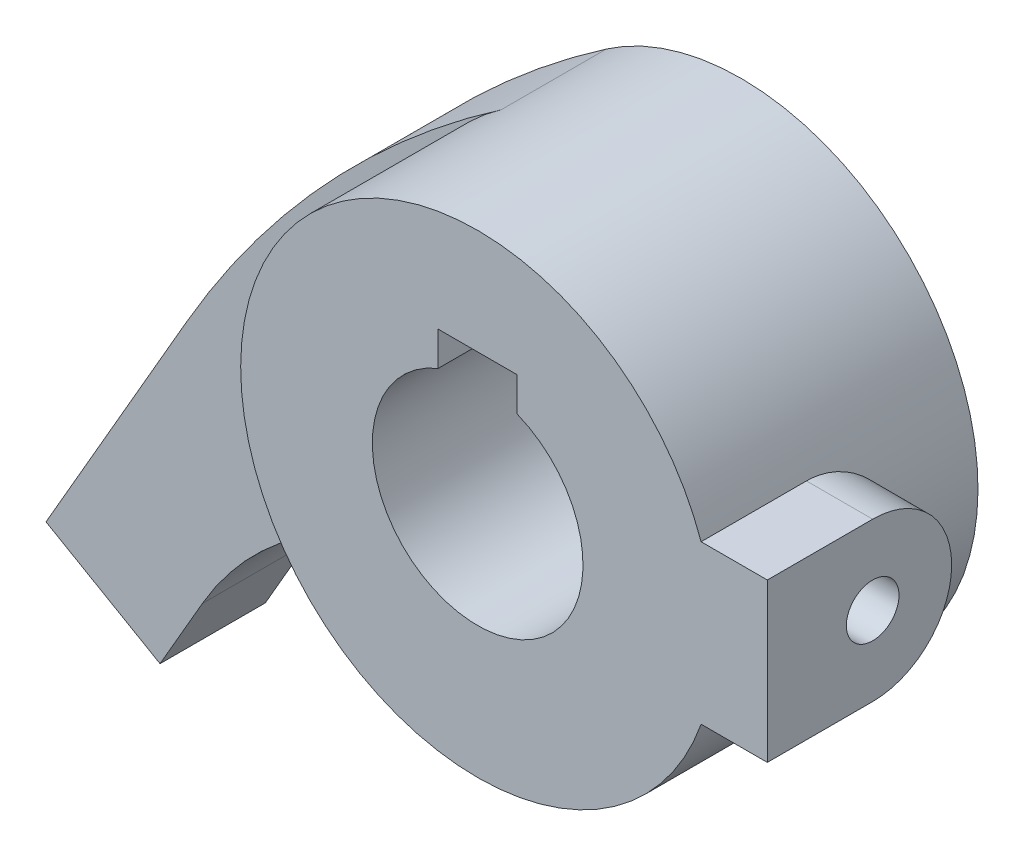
ISO-10303-21;
HEADER;
FILE_DESCRIPTION(('STEP AP214'),'2;1');
FILE_NAME('part.step','',(''),(''),'','','');
FILE_SCHEMA(('AUTOMOTIVE_DESIGN { 1 0 10303 214 1 1 1 1 }'));
ENDSEC;
DATA;
#1=APPLICATION_CONTEXT('core data for automotive mechanical design processes');
#2=APPLICATION_PROTOCOL_DEFINITION('international standard','automotive_design',2000,#1);
#3=PRODUCT_CONTEXT('',#1,'mechanical');
#4=PRODUCT('Part','Part','',(#3));
#5=PRODUCT_RELATED_PRODUCT_CATEGORY('part','',(#4));
#6=PRODUCT_DEFINITION_FORMATION('','',#4);
#7=PRODUCT_DEFINITION_CONTEXT('part definition',#1,'design');
#8=PRODUCT_DEFINITION('design','',#6,#7);
#9=PRODUCT_DEFINITION_SHAPE('','',#8);
#10=(LENGTH_UNIT() NAMED_UNIT(*) SI_UNIT(.MILLI.,.METRE.));
#11=(NAMED_UNIT(*) PLANE_ANGLE_UNIT() SI_UNIT($,.RADIAN.));
#12=(NAMED_UNIT(*) SI_UNIT($,.STERADIAN.) SOLID_ANGLE_UNIT());
#13=UNCERTAINTY_MEASURE_WITH_UNIT(LENGTH_MEASURE(1.E-05),#10,'distance_accuracy_value','');
#14=(GEOMETRIC_REPRESENTATION_CONTEXT(3) GLOBAL_UNCERTAINTY_ASSIGNED_CONTEXT((#13)) GLOBAL_UNIT_ASSIGNED_CONTEXT((#10,
#11,#12)) REPRESENTATION_CONTEXT('',''));
#15=CARTESIAN_POINT('',(0.,0.,0.));
#16=DIRECTION('',(0.,0.,1.));
#17=DIRECTION('',(1.,0.,0.));
#18=AXIS2_PLACEMENT_3D('',#15,#16,#17);
#19=CARTESIAN_POINT('',(0.,0.,20.));
#20=DIRECTION('',(0.,0.,-1.));
#21=DIRECTION('',(-1.,0.,0.));
#22=AXIS2_PLACEMENT_3D('',#19,#20,#21);
#23=CYLINDRICAL_SURFACE('',#22,18.);
#24=CARTESIAN_POINT('',(0.,0.,20.));
#25=DIRECTION('',(0.,0.,1.));
#26=DIRECTION('',(1.,0.,0.));
#27=AXIS2_PLACEMENT_3D('',#24,#25,#26);
#28=CIRCLE('',#27,18.);
#29=CARTESIAN_POINT('',(16.9705627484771,6.,20.));
#30=VERTEX_POINT('',#29);
#31=CARTESIAN_POINT('',(16.9705627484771,-6.,20.));
#32=VERTEX_POINT('',#31);
#33=EDGE_CURVE('E56',#30,#32,#28,.T.);
#34=ORIENTED_EDGE('',*,*,#33,.F.);
#35=DIRECTION('',(0.,0.,-1.));
#36=VECTOR('',#35,1.);
#37=CARTESIAN_POINT('',(16.9705627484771,6.,20.));
#38=LINE('',#37,#36);
#39=CARTESIAN_POINT('',(16.9705627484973,6.,12.));
#40=VERTEX_POINT('',#39);
#41=EDGE_CURVE('E171',#40,#30,#38,.F.);
#42=ORIENTED_EDGE('',*,*,#41,.F.);
#43=CARTESIAN_POINT('',(16.9705627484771,-6.,12.));
#44=CARTESIAN_POINT('',(16.9705358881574,-6.00002327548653,11.8363059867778));
#45=CARTESIAN_POINT('',(16.9729302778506,-5.99330214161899,11.6726221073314));
#46=CARTESIAN_POINT('',(16.9823649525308,-5.96654425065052,11.3465240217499));
#47=CARTESIAN_POINT('',(16.9894039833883,-5.94651108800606,11.1841094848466));
#48=CARTESIAN_POINT('',(17.0079041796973,-5.89338071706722,10.8621857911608));
#49=CARTESIAN_POINT('',(17.0193522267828,-5.86032225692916,10.7026694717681));
#50=CARTESIAN_POINT('',(17.0463054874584,-5.78145443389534,10.3871697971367));
#51=CARTESIAN_POINT('',(17.0618108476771,-5.73564461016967,10.231186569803));
#52=CARTESIAN_POINT('',(17.096396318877,-5.63171582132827,9.92393152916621));
#53=CARTESIAN_POINT('',(17.1154735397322,-5.57360680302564,9.77265602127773));
#54=CARTESIAN_POINT('',(17.1566605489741,-5.44550500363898,9.47558904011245));
#55=CARTESIAN_POINT('',(17.1787714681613,-5.37550778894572,9.32979963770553));
#56=CARTESIAN_POINT('',(17.2254031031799,-5.22415126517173,9.04461346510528));
#57=CARTESIAN_POINT('',(17.2499242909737,-5.14278972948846,8.90521795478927));
#58=CARTESIAN_POINT('',(17.3007173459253,-4.9692408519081,8.63360277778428));
#59=CARTESIAN_POINT('',(17.326989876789,-4.8770493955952,8.50138586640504));
#60=CARTESIAN_POINT('',(17.3815260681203,-4.67904463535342,8.24043953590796));
#61=CARTESIAN_POINT('',(17.4098272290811,-4.57286774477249,8.11199371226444));
#62=CARTESIAN_POINT('',(17.4667935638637,-4.35021031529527,7.86437382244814));
#63=CARTESIAN_POINT('',(17.49545886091,-4.23372620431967,7.74520299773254));
#64=CARTESIAN_POINT('',(17.5523750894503,-3.99119540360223,7.51691026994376));
#65=CARTESIAN_POINT('',(17.5806260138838,-3.86514855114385,7.40778853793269));
#66=CARTESIAN_POINT('',(17.6359611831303,-3.60425478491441,7.20029931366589));
#67=CARTESIAN_POINT('',(17.6630454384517,-3.46940795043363,7.1019317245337));
#68=CARTESIAN_POINT('',(17.716017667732,-3.1880620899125,6.91417565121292));
#69=CARTESIAN_POINT('',(17.7418552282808,-3.04134950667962,6.82509253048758));
#70=CARTESIAN_POINT('',(17.790803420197,-2.74053335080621,6.65968846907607));
#71=CARTESIAN_POINT('',(17.8139150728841,-2.5864325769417,6.58336274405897));
#72=CARTESIAN_POINT('',(17.8567641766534,-2.27182245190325,6.44406426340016));
#73=CARTESIAN_POINT('',(17.8765010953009,-2.11131209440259,6.38109361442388));
#74=CARTESIAN_POINT('',(17.9120119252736,-1.78513959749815,6.26911941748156));
#75=CARTESIAN_POINT('',(17.9277876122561,-1.61947980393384,6.22010961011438));
#76=CARTESIAN_POINT('',(17.9544516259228,-1.28997729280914,6.13793631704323));
#77=CARTESIAN_POINT('',(17.9654893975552,-1.12626807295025,6.10428575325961));
#78=CARTESIAN_POINT('',(17.9831292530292,-0.796442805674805,6.05074979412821));
#79=CARTESIAN_POINT('',(17.9897331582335,-0.630327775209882,6.03085874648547));
#80=CARTESIAN_POINT('',(17.9983239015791,-0.296898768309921,6.00501776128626));
#81=CARTESIAN_POINT('',(18.0003107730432,-0.129584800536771,5.99906772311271));
#82=CARTESIAN_POINT('',(17.999610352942,0.204943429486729,6.00116890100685));
#83=CARTESIAN_POINT('',(17.9969231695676,0.372157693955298,6.00921979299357));
#84=CARTESIAN_POINT('',(17.987149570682,0.698613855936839,6.038646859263));
#85=CARTESIAN_POINT('',(17.9802409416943,0.857909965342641,6.05948465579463));
#86=CARTESIAN_POINT('',(17.9623622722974,1.17415159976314,6.1138198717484));
#87=CARTESIAN_POINT('',(17.9513908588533,1.33109631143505,6.14732157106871));
#88=CARTESIAN_POINT('',(17.9256761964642,1.64145470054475,6.22667565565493));
#89=CARTESIAN_POINT('',(17.9109342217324,1.79486955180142,6.27252386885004));
#90=CARTESIAN_POINT('',(17.8780472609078,2.09727695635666,6.37621207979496));
#91=CARTESIAN_POINT('',(17.8599009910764,2.24626781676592,6.4340566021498));
#92=CARTESIAN_POINT('',(17.8204139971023,2.54070679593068,6.56208597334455));
#93=CARTESIAN_POINT('',(17.7990354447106,2.686085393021,6.632418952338));
#94=CARTESIAN_POINT('',(17.753792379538,2.97045362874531,6.78440731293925));
#95=CARTESIAN_POINT('',(17.7299270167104,3.10944105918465,6.86606656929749));
#96=CARTESIAN_POINT('',(17.6803107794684,3.38017058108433,7.04012638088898));
#97=CARTESIAN_POINT('',(17.6545598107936,3.51191230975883,7.13252747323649));
#98=CARTESIAN_POINT('',(17.601809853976,3.767400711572,7.32747242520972));
#99=CARTESIAN_POINT('',(17.5748108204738,3.89114709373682,7.43001665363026));
#100=CARTESIAN_POINT('',(17.5189422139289,4.13559143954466,7.64969602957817));
#101=CARTESIAN_POINT('',(17.4900445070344,4.2558696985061,7.76729146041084));
#102=CARTESIAN_POINT('',(17.4324086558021,4.4861132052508,8.01214074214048));
#103=CARTESIAN_POINT('',(17.4036704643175,4.59608167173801,8.13939155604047));
#104=CARTESIAN_POINT('',(17.3471202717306,4.8051173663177,8.40289722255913));
#105=CARTESIAN_POINT('',(17.3193089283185,4.90417696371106,8.53915827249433));
#106=CARTESIAN_POINT('',(17.2654357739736,5.09059336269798,8.81971485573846));
#107=CARTESIAN_POINT('',(17.239373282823,5.17795472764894,8.96400722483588));
#108=CARTESIAN_POINT('',(17.1893738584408,5.34161618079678,9.26203101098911));
#109=CARTESIAN_POINT('',(17.1654753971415,5.41772728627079,9.41587280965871));
#110=CARTESIAN_POINT('',(17.1210224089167,5.556609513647,9.72985774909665));
#111=CARTESIAN_POINT('',(17.1004664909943,5.61938618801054,9.88999823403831));
#112=CARTESIAN_POINT('',(17.0633817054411,5.73100924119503,10.2153228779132));
#113=CARTESIAN_POINT('',(17.0468484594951,5.77987077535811,10.3805013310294));
#114=CARTESIAN_POINT('',(17.0183470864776,5.86325820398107,10.7147529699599));
#115=CARTESIAN_POINT('',(17.0063768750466,5.89779064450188,10.883824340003));
#116=CARTESIAN_POINT('',(16.9882040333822,5.94992929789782,11.2104634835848));
#117=CARTESIAN_POINT('',(16.9816058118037,5.96870055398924,11.3678241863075));
#118=CARTESIAN_POINT('',(16.9727764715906,5.99373749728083,11.6834525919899));
#119=CARTESIAN_POINT('',(16.9705397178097,6.00001932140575,11.8417188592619));
#120=CARTESIAN_POINT('',(16.9705627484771,6.,12.));
#121=B_SPLINE_CURVE_WITH_KNOTS('',3,(#43,#44,#45,#46,#47,#48,#49,#50,#51,#52,#53,#54,#55,#56,
#57,#58,#59,#60,#61,#62,#63,#64,#65,#66,#67,#68,#69,#70,#71,#72,#73,#74,#75,#76,#77,#78,#79,#80,
#81,#82,#83,#84,#85,#86,#87,#88,#89,#90,#91,#92,#93,#94,#95,#96,#97,#98,#99,#100,#101,#102,#103,
#104,#105,#106,#107,#108,#109,#110,#111,#112,#113,#114,#115,#116,#117,#118,#119,#120),
.UNSPECIFIED.,.F.,.F.,(4,2,2,2,2,2,2,2,2,2,2,2,2,2,2,2,2,2,2,2,2,2,2,2,2,2,2,2,2,2,2,2,2,2,2,2,
2,2,4),(0.,0.490910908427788,0.9816893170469,1.47101863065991,1.96036563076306,2.44931837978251,
2.93845388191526,3.42768535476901,3.91710329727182,4.42363425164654,4.93034144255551,
5.43705725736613,5.94376850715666,6.46384823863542,6.98373248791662,7.50369868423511,
8.02343138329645,8.52528690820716,9.02693615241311,9.52858177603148,10.0302157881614,
10.5120543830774,10.9940559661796,11.4758948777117,11.9579158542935,12.4460912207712,
12.9344340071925,13.4228012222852,13.9111862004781,14.4226273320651,14.9339082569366,
15.445544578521,15.9569807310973,16.4762155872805,16.9952338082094,17.5136845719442,
18.0318982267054,18.5071898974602,18.9818670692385),.UNSPECIFIED.);
#122=CARTESIAN_POINT('',(16.9705627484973,-6.,12.));
#123=VERTEX_POINT('',#122);
#124=EDGE_CURVE('E169',#123,#40,#121,.T.);
#125=ORIENTED_EDGE('',*,*,#124,.F.);
#126=DIRECTION('',(0.,0.,-1.));
#127=VECTOR('',#126,1.);
#128=CARTESIAN_POINT('',(16.9705627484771,-6.,20.));
#129=LINE('',#128,#127);
#130=EDGE_CURVE('E177',#32,#123,#129,.T.);
#131=ORIENTED_EDGE('',*,*,#130,.F.);
#132=EDGE_LOOP('',(#34,#42,#125,#131));
#133=FACE_BOUND('',#132,.T.);
#134=DIRECTION('',(0.,0.,-1.));
#135=VECTOR('',#134,1.);
#136=CARTESIAN_POINT('',(-10.2174061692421,14.819062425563,8.));
#137=LINE('',#136,#135);
#138=CARTESIAN_POINT('',(-10.2174061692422,14.819062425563,8.));
#139=VERTEX_POINT('',#138);
#140=CARTESIAN_POINT('',(-10.2174061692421,14.819062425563,0.));
#141=VERTEX_POINT('',#140);
#142=EDGE_CURVE('E68',#139,#141,#137,.T.);
#143=ORIENTED_EDGE('',*,*,#142,.F.);
#144=CARTESIAN_POINT('',(0.,0.,8.));
#145=DIRECTION('',(0.,0.,-1.));
#146=DIRECTION('',(1.,0.,0.));
#147=AXIS2_PLACEMENT_3D('',#144,#145,#146);
#148=CIRCLE('',#147,18.);
#149=CARTESIAN_POINT('',(-4.7127894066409,-17.3720930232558,8.));
#150=VERTEX_POINT('',#149);
#151=EDGE_CURVE('E63',#150,#139,#148,.T.);
#152=ORIENTED_EDGE('',*,*,#151,.F.);
#153=DIRECTION('',(0.,0.,-1.));
#154=VECTOR('',#153,1.);
#155=CARTESIAN_POINT('',(-4.7127894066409,-17.3720930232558,8.));
#156=LINE('',#155,#154);
#157=CARTESIAN_POINT('',(-4.7127894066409,-17.3720930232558,0.));
#158=VERTEX_POINT('',#157);
#159=EDGE_CURVE('E326',#150,#158,#156,.T.);
#160=ORIENTED_EDGE('',*,*,#159,.T.);
#161=CARTESIAN_POINT('',(0.,0.,0.));
#162=DIRECTION('',(0.,0.,1.));
#163=DIRECTION('',(1.,0.,0.));
#164=AXIS2_PLACEMENT_3D('',#161,#162,#163);
#165=CIRCLE('',#164,18.);
#166=EDGE_CURVE('E225',#158,#141,#165,.T.);
#167=ORIENTED_EDGE('',*,*,#166,.T.);
#168=EDGE_LOOP('',(#143,#152,#160,#167));
#169=FACE_BOUND('',#168,.T.);
#170=ADVANCED_FACE('F45',(#133,#169),#23,.T.);
#171=CARTESIAN_POINT('',(0.,0.,20.));
#172=DIRECTION('',(0.,0.,1.));
#173=DIRECTION('',(1.,0.,0.));
#174=AXIS2_PLACEMENT_3D('',#171,#172,#173);
#175=PLANE('',#174);
#176=ORIENTED_EDGE('',*,*,#33,.T.);
#177=DIRECTION('',(1.,0.,0.));
#178=VECTOR('',#177,1.);
#179=CARTESIAN_POINT('',(-500000.,-6.,20.));
#180=LINE('',#179,#178);
#181=CARTESIAN_POINT('',(22.,-6.,20.));
#182=VERTEX_POINT('',#181);
#183=EDGE_CURVE('E264',#32,#182,#180,.T.);
#184=ORIENTED_EDGE('',*,*,#183,.T.);
#185=DIRECTION('',(0.,-1.,0.));
#186=VECTOR('',#185,1.);
#187=CARTESIAN_POINT('',(22.,6.,20.));
#188=LINE('',#187,#186);
#189=CARTESIAN_POINT('',(22.,6.,20.));
#190=VERTEX_POINT('',#189);
#191=EDGE_CURVE('E272',#190,#182,#188,.T.);
#192=ORIENTED_EDGE('',*,*,#191,.F.);
#193=DIRECTION('',(1.,0.,0.));
#194=VECTOR('',#193,1.);
#195=CARTESIAN_POINT('',(-500000.,6.,20.));
#196=LINE('',#195,#194);
#197=EDGE_CURVE('E262',#30,#190,#196,.T.);
#198=ORIENTED_EDGE('',*,*,#197,.F.);
#199=EDGE_LOOP('',(#176,#184,#192,#198));
#200=FACE_BOUND('',#199,.T.);
#201=DIRECTION('',(0.,1.,0.));
#202=VECTOR('',#201,1.);
#203=CARTESIAN_POINT('',(3.,7.41619848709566,20.));
#204=LINE('',#203,#202);
#205=CARTESIAN_POINT('',(3.,7.41619848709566,20.));
#206=VERTEX_POINT('',#205);
#207=CARTESIAN_POINT('',(3.,10.,20.));
#208=VERTEX_POINT('',#207);
#209=EDGE_CURVE('E257',#206,#208,#204,.T.);
#210=ORIENTED_EDGE('',*,*,#209,.F.);
#211=CARTESIAN_POINT('',(0.,0.,20.));
#212=DIRECTION('',(0.,0.,1.));
#213=DIRECTION('',(1.,0.,0.));
#214=AXIS2_PLACEMENT_3D('',#211,#212,#213);
#215=CIRCLE('',#214,8.);
#216=CARTESIAN_POINT('',(-3.,7.41619848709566,20.));
#217=VERTEX_POINT('',#216);
#218=EDGE_CURVE('E242',#217,#206,#215,.T.);
#219=ORIENTED_EDGE('',*,*,#218,.F.);
#220=DIRECTION('',(0.,-1.,0.));
#221=VECTOR('',#220,1.);
#222=CARTESIAN_POINT('',(-3.,7.41619848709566,20.));
#223=LINE('',#222,#221);
#224=CARTESIAN_POINT('',(-3.,10.,20.));
#225=VERTEX_POINT('',#224);
#226=EDGE_CURVE('E238',#225,#217,#223,.T.);
#227=ORIENTED_EDGE('',*,*,#226,.F.);
#228=DIRECTION('',(-1.,0.,0.));
#229=VECTOR('',#228,1.);
#230=CARTESIAN_POINT('',(-3.,10.,20.));
#231=LINE('',#230,#229);
#232=EDGE_CURVE('E254',#208,#225,#231,.T.);
#233=ORIENTED_EDGE('',*,*,#232,.F.);
#234=EDGE_LOOP('',(#210,#219,#227,#233));
#235=FACE_BOUND('',#234,.T.);
#236=ADVANCED_FACE('F211',(#200,#235),#175,.T.);
#237=CARTESIAN_POINT('',(0.,0.,0.));
#238=DIRECTION('',(0.,0.,1.));
#239=DIRECTION('',(1.,0.,0.));
#240=AXIS2_PLACEMENT_3D('',#237,#238,#239);
#241=PLANE('',#240);
#242=ORIENTED_EDGE('',*,*,#166,.F.);
#243=CARTESIAN_POINT('',(-11.2583302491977,-41.5,0.));
#244=DIRECTION('',(0.,0.,-1.));
#245=DIRECTION('',(1.,0.,0.));
#246=AXIS2_PLACEMENT_3D('',#243,#244,#245);
#247=CIRCLE('',#246,25.);
#248=CARTESIAN_POINT('',(-32.9089653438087,-29.,0.));
#249=VERTEX_POINT('',#248);
#250=EDGE_CURVE('E164',#249,#158,#247,.T.);
#251=ORIENTED_EDGE('',*,*,#250,.F.);
#252=DIRECTION('',(0.499999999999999,0.866025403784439,0.));
#253=VECTOR('',#252,1.);
#254=CARTESIAN_POINT('',(-32.9089653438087,-29.,0.));
#255=LINE('',#254,#253);
#256=CARTESIAN_POINT('',(-36.1243556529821,-34.5692193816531,0.));
#257=VERTEX_POINT('',#256);
#258=EDGE_CURVE('E334',#257,#249,#255,.T.);
#259=ORIENTED_EDGE('',*,*,#258,.F.);
#260=DIRECTION('',(0.866025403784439,-0.499999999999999,0.));
#261=VECTOR('',#260,1.);
#262=CARTESIAN_POINT('',(-44.7846096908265,-29.5692193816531,0.));
#263=LINE('',#262,#261);
#264=CARTESIAN_POINT('',(-44.7846096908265,-29.5692193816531,0.));
#265=VERTEX_POINT('',#264);
#266=EDGE_CURVE('E336',#265,#257,#263,.T.);
#267=ORIENTED_EDGE('',*,*,#266,.F.);
#268=DIRECTION('',(-0.5,-0.866025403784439,0.));
#269=VECTOR('',#268,1.);
#270=CARTESIAN_POINT('',(-34.0887443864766,-11.0434372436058,0.));
#271=LINE('',#270,#269);
#272=CARTESIAN_POINT('',(-34.0887443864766,-11.0434372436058,0.));
#273=VERTEX_POINT('',#272);
#274=EDGE_CURVE('E349',#273,#265,#271,.T.);
#275=ORIENTED_EDGE('',*,*,#274,.F.);
#276=CARTESIAN_POINT('',(35.1932879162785,-51.0434372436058,0.));
#277=DIRECTION('',(0.,0.,1.));
#278=DIRECTION('',(1.,0.,0.));
#279=AXIS2_PLACEMENT_3D('',#276,#277,#278);
#280=CIRCLE('',#279,80.);
#281=EDGE_CURVE('E168',#141,#273,#280,.T.);
#282=ORIENTED_EDGE('',*,*,#281,.F.);
#283=EDGE_LOOP('',(#242,#251,#259,#267,#275,#282));
#284=FACE_BOUND('',#283,.T.);
#285=CARTESIAN_POINT('',(0.,0.,0.));
#286=DIRECTION('',(0.,0.,1.));
#287=DIRECTION('',(1.,0.,0.));
#288=AXIS2_PLACEMENT_3D('',#285,#286,#287);
#289=CIRCLE('',#288,8.);
#290=CARTESIAN_POINT('',(-3.,7.41619848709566,0.));
#291=VERTEX_POINT('',#290);
#292=CARTESIAN_POINT('',(3.,7.41619848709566,0.));
#293=VERTEX_POINT('',#292);
#294=EDGE_CURVE('E249',#291,#293,#289,.T.);
#295=ORIENTED_EDGE('',*,*,#294,.T.);
#296=DIRECTION('',(0.,1.,0.));
#297=VECTOR('',#296,1.);
#298=CARTESIAN_POINT('',(3.,7.41619848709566,0.));
#299=LINE('',#298,#297);
#300=CARTESIAN_POINT('',(3.,10.,0.));
#301=VERTEX_POINT('',#300);
#302=EDGE_CURVE('E246',#293,#301,#299,.T.);
#303=ORIENTED_EDGE('',*,*,#302,.T.);
#304=DIRECTION('',(-1.,0.,0.));
#305=VECTOR('',#304,1.);
#306=CARTESIAN_POINT('',(-3.,10.,0.));
#307=LINE('',#306,#305);
#308=CARTESIAN_POINT('',(-3.,10.,0.));
#309=VERTEX_POINT('',#308);
#310=EDGE_CURVE('E243',#301,#309,#307,.T.);
#311=ORIENTED_EDGE('',*,*,#310,.T.);
#312=DIRECTION('',(0.,-1.,0.));
#313=VECTOR('',#312,1.);
#314=CARTESIAN_POINT('',(-3.,7.41619848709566,0.));
#315=LINE('',#314,#313);
#316=EDGE_CURVE('E239',#309,#291,#315,.T.);
#317=ORIENTED_EDGE('',*,*,#316,.T.);
#318=EDGE_LOOP('',(#295,#303,#311,#317));
#319=FACE_BOUND('',#318,.T.);
#320=ADVANCED_FACE('F216',(#284,#319),#241,.F.);
#321=CARTESIAN_POINT('',(0.,0.,20.));
#322=DIRECTION('',(0.,0.,-1.));
#323=DIRECTION('',(-1.,0.,0.));
#324=AXIS2_PLACEMENT_3D('',#321,#322,#323);
#325=CYLINDRICAL_SURFACE('',#324,8.);
#326=ORIENTED_EDGE('',*,*,#294,.F.);
#327=DIRECTION('',(0.,0.,-1.));
#328=VECTOR('',#327,1.);
#329=CARTESIAN_POINT('',(-3.,7.41619848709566,20.));
#330=LINE('',#329,#328);
#331=EDGE_CURVE('E235',#217,#291,#330,.T.);
#332=ORIENTED_EDGE('',*,*,#331,.F.);
#333=ORIENTED_EDGE('',*,*,#218,.T.);
#334=DIRECTION('',(0.,0.,-1.));
#335=VECTOR('',#334,1.);
#336=CARTESIAN_POINT('',(3.,7.41619848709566,20.));
#337=LINE('',#336,#335);
#338=EDGE_CURVE('E227',#206,#293,#337,.T.);
#339=ORIENTED_EDGE('',*,*,#338,.T.);
#340=EDGE_LOOP('',(#326,#332,#333,#339));
#341=FACE_BOUND('',#340,.T.);
#342=ADVANCED_FACE('F304',(#341),#325,.F.);
#343=CARTESIAN_POINT('',(3.,7.41619848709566,20.));
#344=DIRECTION('',(-1.,0.,0.));
#345=DIRECTION('',(0.,0.,1.));
#346=AXIS2_PLACEMENT_3D('',#343,#344,#345);
#347=PLANE('',#346);
#348=ORIENTED_EDGE('',*,*,#302,.F.);
#349=ORIENTED_EDGE('',*,*,#338,.F.);
#350=ORIENTED_EDGE('',*,*,#209,.T.);
#351=DIRECTION('',(0.,0.,-1.));
#352=VECTOR('',#351,1.);
#353=CARTESIAN_POINT('',(3.,10.,20.));
#354=LINE('',#353,#352);
#355=EDGE_CURVE('E231',#208,#301,#354,.T.);
#356=ORIENTED_EDGE('',*,*,#355,.T.);
#357=EDGE_LOOP('',(#348,#349,#350,#356));
#358=FACE_BOUND('',#357,.T.);
#359=ADVANCED_FACE('F300',(#358),#347,.T.);
#360=CARTESIAN_POINT('',(-3.,10.,20.));
#361=DIRECTION('',(0.,-1.,0.));
#362=DIRECTION('',(0.,0.,-1.));
#363=AXIS2_PLACEMENT_3D('',#360,#361,#362);
#364=PLANE('',#363);
#365=ORIENTED_EDGE('',*,*,#310,.F.);
#366=ORIENTED_EDGE('',*,*,#355,.F.);
#367=ORIENTED_EDGE('',*,*,#232,.T.);
#368=DIRECTION('',(0.,0.,-1.));
#369=VECTOR('',#368,1.);
#370=CARTESIAN_POINT('',(-3.,10.,20.));
#371=LINE('',#370,#369);
#372=EDGE_CURVE('E233',#225,#309,#371,.T.);
#373=ORIENTED_EDGE('',*,*,#372,.T.);
#374=EDGE_LOOP('',(#365,#366,#367,#373));
#375=FACE_BOUND('',#374,.T.);
#376=ADVANCED_FACE('F203',(#375),#364,.T.);
#377=CARTESIAN_POINT('',(-3.,7.41619848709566,20.));
#378=DIRECTION('',(1.,0.,0.));
#379=DIRECTION('',(0.,1.,0.));
#380=AXIS2_PLACEMENT_3D('',#377,#378,#379);
#381=PLANE('',#380);
#382=ORIENTED_EDGE('',*,*,#316,.F.);
#383=ORIENTED_EDGE('',*,*,#372,.F.);
#384=ORIENTED_EDGE('',*,*,#226,.T.);
#385=ORIENTED_EDGE('',*,*,#331,.T.);
#386=EDGE_LOOP('',(#382,#383,#384,#385));
#387=FACE_BOUND('',#386,.T.);
#388=ADVANCED_FACE('F195',(#387),#381,.T.);
#389=CARTESIAN_POINT('',(-500000.,6.,12.));
#390=DIRECTION('',(0.,1.,0.));
#391=DIRECTION('',(0.,0.,1.));
#392=AXIS2_PLACEMENT_3D('',#389,#390,#391);
#393=PLANE('',#392);
#394=DIRECTION('',(1.,0.,0.));
#395=VECTOR('',#394,1.);
#396=CARTESIAN_POINT('',(-500000.,6.,12.));
#397=LINE('',#396,#395);
#398=CARTESIAN_POINT('',(22.,6.,12.));
#399=VERTEX_POINT('',#398);
#400=EDGE_CURVE('E260',#40,#399,#397,.T.);
#401=ORIENTED_EDGE('',*,*,#400,.F.);
#402=ORIENTED_EDGE('',*,*,#41,.T.);
#403=ORIENTED_EDGE('',*,*,#197,.T.);
#404=DIRECTION('',(0.,0.,1.));
#405=VECTOR('',#404,1.);
#406=CARTESIAN_POINT('',(22.,6.,12.));
#407=LINE('',#406,#405);
#408=EDGE_CURVE('E275',#399,#190,#407,.T.);
#409=ORIENTED_EDGE('',*,*,#408,.F.);
#410=EDGE_LOOP('',(#401,#402,#403,#409));
#411=FACE_BOUND('',#410,.T.);
#412=ADVANCED_FACE('F193',(#411),#393,.T.);
#413=CARTESIAN_POINT('',(22.,0.,12.));
#414=DIRECTION('',(1.,0.,0.));
#415=DIRECTION('',(0.,0.,-1.));
#416=AXIS2_PLACEMENT_3D('',#413,#414,#415);
#417=PLANE('',#416);
#418=CARTESIAN_POINT('',(22.,0.,12.));
#419=DIRECTION('',(1.,0.,0.));
#420=DIRECTION('',(0.,0.,-1.));
#421=AXIS2_PLACEMENT_3D('',#418,#419,#420);
#422=CIRCLE('',#421,2.);
#423=CARTESIAN_POINT('',(22.,0.,10.));
#424=VERTEX_POINT('',#423);
#425=EDGE_CURVE('E268',#424,#424,#422,.T.);
#426=ORIENTED_EDGE('',*,*,#425,.F.);
#427=EDGE_LOOP('',(#426));
#428=FACE_BOUND('',#427,.T.);
#429=CARTESIAN_POINT('',(22.,0.,12.));
#430=DIRECTION('',(1.,0.,0.));
#431=DIRECTION('',(0.,0.,-1.));
#432=AXIS2_PLACEMENT_3D('',#429,#430,#431);
#433=CIRCLE('',#432,6.);
#434=CARTESIAN_POINT('',(22.,-6.,12.));
#435=VERTEX_POINT('',#434);
#436=EDGE_CURVE('E252',#435,#399,#433,.T.);
#437=ORIENTED_EDGE('',*,*,#436,.T.);
#438=ORIENTED_EDGE('',*,*,#408,.T.);
#439=ORIENTED_EDGE('',*,*,#191,.T.);
#440=DIRECTION('',(0.,0.,-1.));
#441=VECTOR('',#440,1.);
#442=CARTESIAN_POINT('',(22.,-6.,12.));
#443=LINE('',#442,#441);
#444=EDGE_CURVE('E271',#182,#435,#443,.T.);
#445=ORIENTED_EDGE('',*,*,#444,.T.);
#446=EDGE_LOOP('',(#437,#438,#439,#445));
#447=FACE_BOUND('',#446,.T.);
#448=ADVANCED_FACE('F191',(#428,#447),#417,.T.);
#449=CARTESIAN_POINT('',(-500000.,0.,12.));
#450=DIRECTION('',(1.,0.,0.));
#451=DIRECTION('',(0.,0.,-1.));
#452=AXIS2_PLACEMENT_3D('',#449,#450,#451);
#453=CYLINDRICAL_SURFACE('',#452,6.);
#454=DIRECTION('',(1.,0.,0.));
#455=VECTOR('',#454,1.);
#456=CARTESIAN_POINT('',(-500000.,-6.,12.));
#457=LINE('',#456,#455);
#458=EDGE_CURVE('E266',#123,#435,#457,.T.);
#459=ORIENTED_EDGE('',*,*,#458,.F.);
#460=ORIENTED_EDGE('',*,*,#124,.T.);
#461=ORIENTED_EDGE('',*,*,#400,.T.);
#462=ORIENTED_EDGE('',*,*,#436,.F.);
#463=EDGE_LOOP('',(#459,#460,#461,#462));
#464=FACE_BOUND('',#463,.T.);
#465=ADVANCED_FACE('F185',(#464),#453,.T.);
#466=CARTESIAN_POINT('',(-500000.,-6.,12.));
#467=DIRECTION('',(0.,-1.,0.));
#468=DIRECTION('',(0.,0.,-1.));
#469=AXIS2_PLACEMENT_3D('',#466,#467,#468);
#470=PLANE('',#469);
#471=ORIENTED_EDGE('',*,*,#183,.F.);
#472=ORIENTED_EDGE('',*,*,#130,.T.);
#473=ORIENTED_EDGE('',*,*,#458,.T.);
#474=ORIENTED_EDGE('',*,*,#444,.F.);
#475=EDGE_LOOP('',(#471,#472,#473,#474));
#476=FACE_BOUND('',#475,.T.);
#477=ADVANCED_FACE('F289',(#476),#470,.T.);
#478=CARTESIAN_POINT('',(-500000.,0.,12.));
#479=DIRECTION('',(1.,0.,0.));
#480=DIRECTION('',(0.,0.,-1.));
#481=AXIS2_PLACEMENT_3D('',#478,#479,#480);
#482=CYLINDRICAL_SURFACE('',#481,2.);
#483=ORIENTED_EDGE('',*,*,#425,.T.);
#484=EDGE_LOOP('',(#483));
#485=FACE_BOUND('',#484,.T.);
#486=CARTESIAN_POINT('',(18.,0.,10.));
#487=CARTESIAN_POINT('',(17.9999985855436,-0.111970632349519,10.0000048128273));
#488=CARTESIAN_POINT('',(17.9989441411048,-0.22401360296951,10.0094347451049));
#489=CARTESIAN_POINT('',(17.9948391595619,-0.444988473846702,10.0469075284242));
#490=CARTESIAN_POINT('',(17.9917864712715,-0.553916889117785,10.0749704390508));
#491=CARTESIAN_POINT('',(17.9840293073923,-0.76543107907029,10.1488779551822));
#492=CARTESIAN_POINT('',(17.9793258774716,-0.868020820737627,10.1947113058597));
#493=CARTESIAN_POINT('',(17.9687919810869,-1.06403053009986,10.3028356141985));
#494=CARTESIAN_POINT('',(17.9629617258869,-1.1574522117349,10.3651234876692));
#495=CARTESIAN_POINT('',(17.9507977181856,-1.33290575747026,10.5046820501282));
#496=CARTESIAN_POINT('',(17.9444620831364,-1.4148915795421,10.5820104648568));
#497=CARTESIAN_POINT('',(17.9320167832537,-1.5647500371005,10.7493314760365));
#498=CARTESIAN_POINT('',(17.9259071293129,-1.63262199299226,10.8393246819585));
#499=CARTESIAN_POINT('',(17.9145866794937,-1.7524930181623,11.0297139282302));
#500=CARTESIAN_POINT('',(17.9093782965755,-1.80444975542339,11.1301367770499));
#501=CARTESIAN_POINT('',(17.9004741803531,-1.89074517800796,11.3383494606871));
#502=CARTESIAN_POINT('',(17.8967784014,-1.92508439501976,11.446139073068));
#503=CARTESIAN_POINT('',(17.8913354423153,-1.97503194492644,11.6655519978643));
#504=CARTESIAN_POINT('',(17.8895802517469,-1.99071729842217,11.7771575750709));
#505=CARTESIAN_POINT('',(17.8881925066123,-2.00315006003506,12.0014298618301));
#506=CARTESIAN_POINT('',(17.8885598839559,-1.99989807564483,12.1140965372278));
#507=CARTESIAN_POINT('',(17.891368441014,-1.97461184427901,12.3367594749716));
#508=CARTESIAN_POINT('',(17.8938003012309,-1.95266200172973,12.4467654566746));
#509=CARTESIAN_POINT('',(17.9004492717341,-1.89073461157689,12.6615226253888));
#510=CARTESIAN_POINT('',(17.904666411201,-1.85075676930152,12.7662737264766));
#511=CARTESIAN_POINT('',(17.9144214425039,-1.75381606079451,12.9678124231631));
#512=CARTESIAN_POINT('',(17.9199622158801,-1.6968160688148,13.0645820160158));
#513=CARTESIAN_POINT('',(17.9317378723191,-1.56747570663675,13.2472136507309));
#514=CARTESIAN_POINT('',(17.9379727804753,-1.49513478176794,13.3330752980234));
#515=CARTESIAN_POINT('',(17.9504756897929,-1.33669614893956,13.4919439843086));
#516=CARTESIAN_POINT('',(17.9567436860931,-1.25052560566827,13.5648784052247));
#517=CARTESIAN_POINT('',(17.9685745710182,-1.06712581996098,13.6952583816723));
#518=CARTESIAN_POINT('',(17.9741374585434,-0.969896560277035,13.7527039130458));
#519=CARTESIAN_POINT('',(17.9839338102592,-0.767086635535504,13.8504737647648));
#520=CARTESIAN_POINT('',(17.9881669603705,-0.661504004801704,13.8907940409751));
#521=CARTESIAN_POINT('',(17.9948238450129,-0.445009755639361,13.9531137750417));
#522=CARTESIAN_POINT('',(17.997247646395,-0.334098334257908,13.9751139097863));
#523=CARTESIAN_POINT('',(18.0000041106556,-0.110723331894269,14.0000759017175));
#524=CARTESIAN_POINT('',(18.0003477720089,0.00172892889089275,14.0031378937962));
#525=CARTESIAN_POINT('',(17.998934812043,0.225544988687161,13.9904002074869));
#526=CARTESIAN_POINT('',(17.9971782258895,0.33690880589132,13.9746008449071));
#527=CARTESIAN_POINT('',(17.9917690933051,0.555095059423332,13.9246720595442));
#528=CARTESIAN_POINT('',(17.9881214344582,0.661928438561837,13.8905898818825));
#529=CARTESIAN_POINT('',(17.9793390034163,0.868362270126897,13.8051117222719));
#530=CARTESIAN_POINT('',(17.9742041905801,0.967962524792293,13.753715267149));
#531=CARTESIAN_POINT('',(17.9629935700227,1.15755326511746,13.634821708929));
#532=CARTESIAN_POINT('',(17.9569139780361,1.24750253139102,13.5672592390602));
#533=CARTESIAN_POINT('',(17.9445071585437,1.41481983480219,13.4180447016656));
#534=CARTESIAN_POINT('',(17.938179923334,1.49218748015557,13.3363921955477));
#535=CARTESIAN_POINT('',(17.925957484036,1.63249622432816,13.1608767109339));
#536=CARTESIAN_POINT('',(17.920064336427,1.69537132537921,13.0669608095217));
#537=CARTESIAN_POINT('',(17.9094097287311,1.80445556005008,12.8698437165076));
#538=CARTESIAN_POINT('',(17.9046482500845,1.85066496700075,12.7666426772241));
#539=CARTESIAN_POINT('',(17.8968094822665,1.92499712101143,12.5541055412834));
#540=CARTESIAN_POINT('',(17.8937286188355,1.95315827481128,12.4447830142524));
#541=CARTESIAN_POINT('',(17.8895891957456,1.99071877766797,12.2229248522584));
#542=CARTESIAN_POINT('',(17.8885305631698,2.00011880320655,12.1103893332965));
#543=CARTESIAN_POINT('',(17.8885572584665,1.99987957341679,11.8859558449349));
#544=CARTESIAN_POINT('',(17.8896309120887,1.99034399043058,11.774057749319));
#545=CARTESIAN_POINT('',(17.8937762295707,1.9527225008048,11.5534642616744));
#546=CARTESIAN_POINT('',(17.8968478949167,1.92463658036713,11.4447688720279));
#547=CARTESIAN_POINT('',(17.9046397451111,1.85074191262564,11.2336724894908));
#548=CARTESIAN_POINT('',(17.9093595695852,1.80493703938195,11.1312701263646));
#549=CARTESIAN_POINT('',(17.9199166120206,1.69691508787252,10.9355895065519));
#550=CARTESIAN_POINT('',(17.9257538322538,1.63469797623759,10.842311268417));
#551=CARTESIAN_POINT('',(17.9379262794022,1.49522995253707,10.6669957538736));
#552=CARTESIAN_POINT('',(17.944263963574,1.41790170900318,10.5850201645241));
#553=CARTESIAN_POINT('',(17.9567010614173,1.25056419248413,10.4351661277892));
#554=CARTESIAN_POINT('',(17.962800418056,1.16055190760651,10.3672910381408));
#555=CARTESIAN_POINT('',(17.9740935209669,0.970094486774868,10.2473956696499));
#556=CARTESIAN_POINT('',(17.9792844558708,0.869618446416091,10.1954242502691));
#557=CARTESIAN_POINT('',(17.9881463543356,0.66136849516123,10.1091625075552));
#558=CARTESIAN_POINT('',(17.9918190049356,0.55360283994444,10.0748525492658));
#559=CARTESIAN_POINT('',(17.9963232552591,0.371040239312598,10.0333008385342));
#560=CARTESIAN_POINT('',(17.9976954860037,0.297404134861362,10.0208304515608));
#561=CARTESIAN_POINT('',(17.9995343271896,0.149189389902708,10.004178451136));
#562=CARTESIAN_POINT('',(18.000000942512,0.074610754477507,9.99999679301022));
#563=CARTESIAN_POINT('',(18.,0.,10.));
#564=B_SPLINE_CURVE_WITH_KNOTS('',3,(#486,#487,#488,#489,#490,#491,#492,#493,#494,#495,#496,
#497,#498,#499,#500,#501,#502,#503,#504,#505,#506,#507,#508,#509,#510,#511,#512,#513,#514,#515,
#516,#517,#518,#519,#520,#521,#522,#523,#524,#525,#526,#527,#528,#529,#530,#531,#532,#533,#534,
#535,#536,#537,#538,#539,#540,#541,#542,#543,#544,#545,#546,#547,#548,#549,#550,#551,#552,#553,
#554,#555,#556,#557,#558,#559,#560,#561,#562,#563),.UNSPECIFIED.,.T.,.F.,(4,2,2,2,2,2,2,2,2,2,2,
2,2,2,2,2,2,2,2,2,2,2,2,2,2,2,2,2,2,2,2,2,2,2,2,2,2,2,4),(0.,0.335639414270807,
0.671640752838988,1.00742963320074,1.34315561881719,1.68019649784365,2.01725360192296,
2.35519959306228,2.69313538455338,3.02967096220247,3.36619574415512,3.70120941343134,
4.03622855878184,4.37198379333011,4.70775116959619,5.0453487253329,5.3829468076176,
5.72062456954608,6.05828985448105,6.39416820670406,6.73004093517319,7.06504987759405,
7.40006797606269,7.73646430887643,8.07287111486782,8.41078088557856,8.74868511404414,
9.08586787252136,9.42303847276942,9.75836815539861,10.0936980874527,10.4289547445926,
10.7642120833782,11.1012322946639,11.4383326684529,11.7764585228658,12.1142076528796,
12.3378595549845,12.5615102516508),.UNSPECIFIED.);
#565=CARTESIAN_POINT('',(18.,0.,10.));
#566=VERTEX_POINT('',#565);
#567=EDGE_CURVE('E12',#566,#566,#564,.T.);
#568=ORIENTED_EDGE('',*,*,#567,.T.);
#569=EDGE_LOOP('',(#568));
#570=FACE_BOUND('',#569,.T.);
#571=ADVANCED_FACE('F206',(#485,#570),#482,.F.);
#572=ORIENTED_EDGE('',*,*,#567,.F.);
#573=EDGE_LOOP('',(#572));
#574=FACE_BOUND('',#573,.T.);
#575=ADVANCED_FACE('F197',(#574),#23,.T.);
#576=CARTESIAN_POINT('',(35.1932879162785,-51.0434372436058,8.));
#577=DIRECTION('',(0.,0.,-1.));
#578=DIRECTION('',(-1.,0.,0.));
#579=AXIS2_PLACEMENT_3D('',#576,#577,#578);
#580=CYLINDRICAL_SURFACE('',#579,80.);
#581=ORIENTED_EDGE('',*,*,#281,.T.);
#582=DIRECTION('',(0.,0.,-1.));
#583=VECTOR('',#582,1.);
#584=CARTESIAN_POINT('',(-34.0887443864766,-11.0434372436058,8.));
#585=LINE('',#584,#583);
#586=CARTESIAN_POINT('',(-34.0887443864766,-11.0434372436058,8.));
#587=VERTEX_POINT('',#586);
#588=EDGE_CURVE('E152',#587,#273,#585,.T.);
#589=ORIENTED_EDGE('',*,*,#588,.F.);
#590=CARTESIAN_POINT('',(35.1932879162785,-51.0434372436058,8.));
#591=DIRECTION('',(0.,0.,1.));
#592=DIRECTION('',(1.,0.,0.));
#593=AXIS2_PLACEMENT_3D('',#590,#591,#592);
#594=CIRCLE('',#593,80.);
#595=EDGE_CURVE('E159',#139,#587,#594,.T.);
#596=ORIENTED_EDGE('',*,*,#595,.F.);
#597=ORIENTED_EDGE('',*,*,#142,.T.);
#598=EDGE_LOOP('',(#581,#589,#596,#597));
#599=FACE_BOUND('',#598,.T.);
#600=ADVANCED_FACE('F166',(#599),#580,.T.);
#601=CARTESIAN_POINT('',(-34.0887443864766,-11.0434372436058,8.));
#602=DIRECTION('',(0.866025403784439,-0.5,0.));
#603=DIRECTION('',(0.5,0.866025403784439,0.));
#604=AXIS2_PLACEMENT_3D('',#601,#602,#603);
#605=PLANE('',#604);
#606=ORIENTED_EDGE('',*,*,#274,.T.);
#607=DIRECTION('',(0.,0.,-1.));
#608=VECTOR('',#607,1.);
#609=CARTESIAN_POINT('',(-44.7846096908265,-29.5692193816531,8.));
#610=LINE('',#609,#608);
#611=CARTESIAN_POINT('',(-44.7846096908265,-29.5692193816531,8.));
#612=VERTEX_POINT('',#611);
#613=EDGE_CURVE('E155',#612,#265,#610,.T.);
#614=ORIENTED_EDGE('',*,*,#613,.F.);
#615=DIRECTION('',(-0.5,-0.866025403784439,0.));
#616=VECTOR('',#615,1.);
#617=CARTESIAN_POINT('',(-34.0887443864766,-11.0434372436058,8.));
#618=LINE('',#617,#616);
#619=EDGE_CURVE('E148',#587,#612,#618,.T.);
#620=ORIENTED_EDGE('',*,*,#619,.F.);
#621=ORIENTED_EDGE('',*,*,#588,.T.);
#622=EDGE_LOOP('',(#606,#614,#620,#621));
#623=FACE_BOUND('',#622,.T.);
#624=ADVANCED_FACE('F150',(#623),#605,.F.);
#625=CARTESIAN_POINT('',(-44.7846096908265,-29.5692193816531,8.));
#626=DIRECTION('',(0.499999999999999,0.866025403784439,0.));
#627=DIRECTION('',(-0.866025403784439,0.499999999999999,0.));
#628=AXIS2_PLACEMENT_3D('',#625,#626,#627);
#629=PLANE('',#628);
#630=ORIENTED_EDGE('',*,*,#266,.T.);
#631=DIRECTION('',(0.,0.,-1.));
#632=VECTOR('',#631,1.);
#633=CARTESIAN_POINT('',(-36.1243556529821,-34.5692193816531,8.));
#634=LINE('',#633,#632);
#635=CARTESIAN_POINT('',(-36.1243556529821,-34.5692193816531,8.));
#636=VERTEX_POINT('',#635);
#637=EDGE_CURVE('E173',#636,#257,#634,.T.);
#638=ORIENTED_EDGE('',*,*,#637,.F.);
#639=DIRECTION('',(0.866025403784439,-0.499999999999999,0.));
#640=VECTOR('',#639,1.);
#641=CARTESIAN_POINT('',(-44.7846096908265,-29.5692193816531,8.));
#642=LINE('',#641,#640);
#643=EDGE_CURVE('E158',#612,#636,#642,.T.);
#644=ORIENTED_EDGE('',*,*,#643,.F.);
#645=ORIENTED_EDGE('',*,*,#613,.T.);
#646=EDGE_LOOP('',(#630,#638,#644,#645));
#647=FACE_BOUND('',#646,.T.);
#648=ADVANCED_FACE('F357',(#647),#629,.F.);
#649=CARTESIAN_POINT('',(-32.9089653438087,-29.,8.));
#650=DIRECTION('',(-0.866025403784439,0.499999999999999,0.));
#651=DIRECTION('',(-0.499999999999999,-0.866025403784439,0.));
#652=AXIS2_PLACEMENT_3D('',#649,#650,#651);
#653=PLANE('',#652);
#654=ORIENTED_EDGE('',*,*,#258,.T.);
#655=DIRECTION('',(0.,0.,-1.));
#656=VECTOR('',#655,1.);
#657=CARTESIAN_POINT('',(-32.9089653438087,-29.,8.));
#658=LINE('',#657,#656);
#659=CARTESIAN_POINT('',(-32.9089653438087,-29.,8.));
#660=VERTEX_POINT('',#659);
#661=EDGE_CURVE('E329',#660,#249,#658,.T.);
#662=ORIENTED_EDGE('',*,*,#661,.F.);
#663=DIRECTION('',(0.499999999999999,0.866025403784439,0.));
#664=VECTOR('',#663,1.);
#665=CARTESIAN_POINT('',(-32.9089653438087,-29.,8.));
#666=LINE('',#665,#664);
#667=EDGE_CURVE('E346',#636,#660,#666,.T.);
#668=ORIENTED_EDGE('',*,*,#667,.F.);
#669=ORIENTED_EDGE('',*,*,#637,.T.);
#670=EDGE_LOOP('',(#654,#662,#668,#669));
#671=FACE_BOUND('',#670,.T.);
#672=ADVANCED_FACE('F345',(#671),#653,.F.);
#673=CARTESIAN_POINT('',(-11.2583302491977,-41.5,8.));
#674=DIRECTION('',(0.,0.,-1.));
#675=DIRECTION('',(-1.,0.,0.));
#676=AXIS2_PLACEMENT_3D('',#673,#674,#675);
#677=CYLINDRICAL_SURFACE('',#676,25.);
#678=ORIENTED_EDGE('',*,*,#250,.T.);
#679=ORIENTED_EDGE('',*,*,#159,.F.);
#680=CARTESIAN_POINT('',(-11.2583302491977,-41.5,8.));
#681=DIRECTION('',(0.,0.,-1.));
#682=DIRECTION('',(1.,0.,0.));
#683=AXIS2_PLACEMENT_3D('',#680,#681,#682);
#684=CIRCLE('',#683,25.);
#685=EDGE_CURVE('E354',#660,#150,#684,.T.);
#686=ORIENTED_EDGE('',*,*,#685,.F.);
#687=ORIENTED_EDGE('',*,*,#661,.T.);
#688=EDGE_LOOP('',(#678,#679,#686,#687));
#689=FACE_BOUND('',#688,.T.);
#690=ADVANCED_FACE('F332',(#689),#677,.F.);
#691=CARTESIAN_POINT('',(35.1932879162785,-51.0434372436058,8.));
#692=DIRECTION('',(0.,0.,1.));
#693=DIRECTION('',(1.,0.,0.));
#694=AXIS2_PLACEMENT_3D('',#691,#692,#693);
#695=PLANE('',#694);
#696=ORIENTED_EDGE('',*,*,#595,.T.);
#697=ORIENTED_EDGE('',*,*,#619,.T.);
#698=ORIENTED_EDGE('',*,*,#643,.T.);
#699=ORIENTED_EDGE('',*,*,#667,.T.);
#700=ORIENTED_EDGE('',*,*,#685,.T.);
#701=ORIENTED_EDGE('',*,*,#151,.T.);
#702=EDGE_LOOP('',(#696,#697,#698,#699,#700,#701));
#703=FACE_BOUND('',#702,.T.);
#704=ADVANCED_FACE('F162',(#703),#695,.T.);
#705=CLOSED_SHELL('',(#170,#236,#320,#342,#359,#376,#388,#412,#448,#465,#477,#571,#575,#600,
#624,#648,#672,#690,#704));
#706=MANIFOLD_SOLID_BREP('B2',#705);
#707=ADVANCED_BREP_SHAPE_REPRESENTATION('',(#18,#706),#14);
#708=SHAPE_DEFINITION_REPRESENTATION(#9,#707);
ENDSEC;
END-ISO-10303-21;
